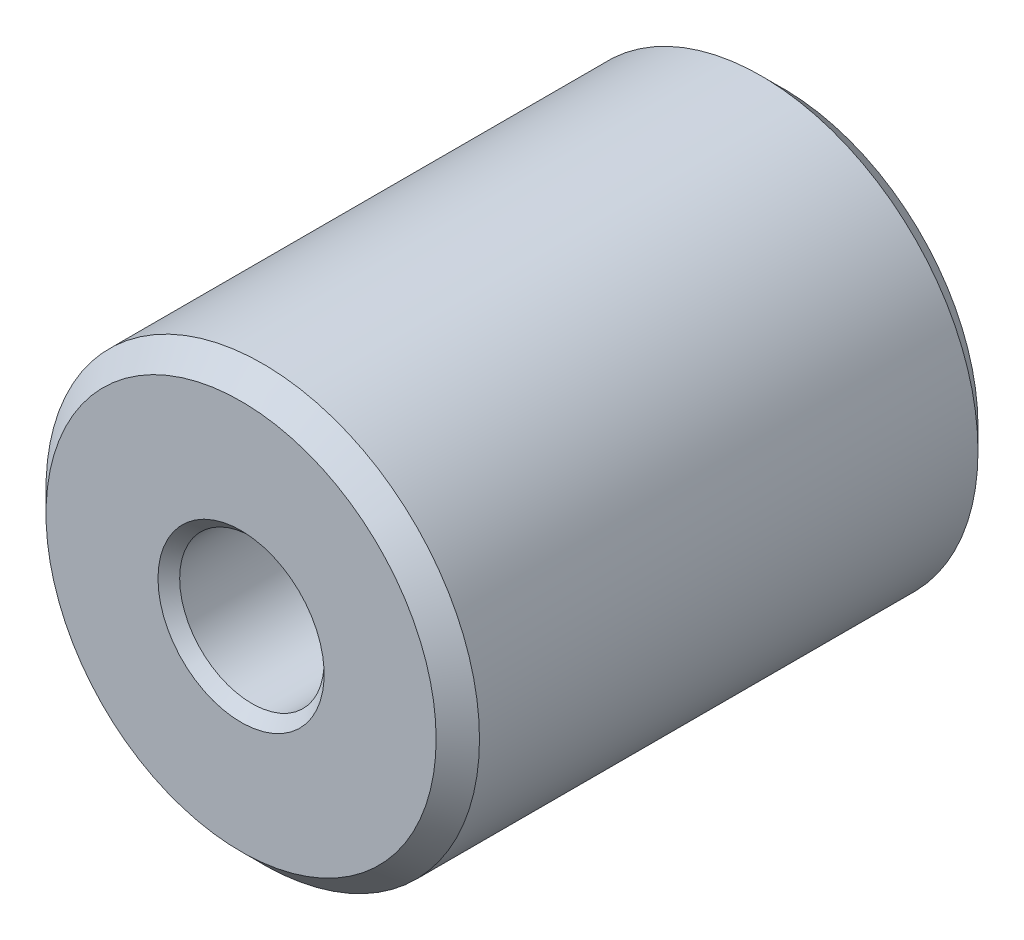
ISO-10303-21;
HEADER;
FILE_DESCRIPTION(('STEP AP214'),'2;1');
FILE_NAME('part.step','',(''),(''),'','','');
FILE_SCHEMA(('AUTOMOTIVE_DESIGN { 1 0 10303 214 1 1 1 1 }'));
ENDSEC;
DATA;
#1=APPLICATION_CONTEXT('core data for automotive mechanical design processes');
#2=APPLICATION_PROTOCOL_DEFINITION('international standard','automotive_design',2000,#1);
#3=PRODUCT_CONTEXT('',#1,'mechanical');
#4=PRODUCT('Part','Part','',(#3));
#5=PRODUCT_RELATED_PRODUCT_CATEGORY('part','',(#4));
#6=PRODUCT_DEFINITION_FORMATION('','',#4);
#7=PRODUCT_DEFINITION_CONTEXT('part definition',#1,'design');
#8=PRODUCT_DEFINITION('design','',#6,#7);
#9=PRODUCT_DEFINITION_SHAPE('','',#8);
#10=(LENGTH_UNIT() NAMED_UNIT(*) SI_UNIT(.MILLI.,.METRE.));
#11=(NAMED_UNIT(*) PLANE_ANGLE_UNIT() SI_UNIT($,.RADIAN.));
#12=(NAMED_UNIT(*) SI_UNIT($,.STERADIAN.) SOLID_ANGLE_UNIT());
#13=UNCERTAINTY_MEASURE_WITH_UNIT(LENGTH_MEASURE(1.E-05),#10,'distance_accuracy_value','');
#14=(GEOMETRIC_REPRESENTATION_CONTEXT(3) GLOBAL_UNCERTAINTY_ASSIGNED_CONTEXT((#13)) GLOBAL_UNIT_ASSIGNED_CONTEXT((#10,
#11,#12)) REPRESENTATION_CONTEXT('',''));
#15=CARTESIAN_POINT('',(0.,0.,0.));
#16=DIRECTION('',(0.,0.,1.));
#17=DIRECTION('',(1.,0.,0.));
#18=AXIS2_PLACEMENT_3D('',#15,#16,#17);
#19=CARTESIAN_POINT('',(0.,0.,30.));
#20=DIRECTION('',(0.,0.,1.));
#21=DIRECTION('',(1.,0.,0.));
#22=AXIS2_PLACEMENT_3D('',#19,#20,#21);
#23=PLANE('',#22);
#24=CARTESIAN_POINT('',(0.,0.,30.));
#25=DIRECTION('',(0.,0.,1.));
#26=DIRECTION('',(1.,0.,0.));
#27=AXIS2_PLACEMENT_3D('',#24,#25,#26);
#28=CIRCLE('',#27,10.8);
#29=CARTESIAN_POINT('',(10.8,0.,30.));
#30=VERTEX_POINT('',#29);
#31=EDGE_CURVE('E19',#30,#30,#28,.T.);
#32=ORIENTED_EDGE('',*,*,#31,.T.);
#33=EDGE_LOOP('',(#32));
#34=FACE_BOUND('',#33,.T.);
#35=CARTESIAN_POINT('',(0.,0.,30.));
#36=DIRECTION('',(0.,0.,-1.));
#37=DIRECTION('',(-1.,0.,0.));
#38=AXIS2_PLACEMENT_3D('',#35,#36,#37);
#39=CIRCLE('',#38,4.6);
#40=CARTESIAN_POINT('',(-4.6,0.,30.));
#41=VERTEX_POINT('',#40);
#42=EDGE_CURVE('E41',#41,#41,#39,.T.);
#43=ORIENTED_EDGE('',*,*,#42,.T.);
#44=EDGE_LOOP('',(#43));
#45=FACE_BOUND('',#44,.T.);
#46=ADVANCED_FACE('F12',(#34,#45),#23,.T.);
#47=CARTESIAN_POINT('',(0.,0.,30.));
#48=DIRECTION('',(0.,0.,-1.));
#49=DIRECTION('',(-1.,0.,0.));
#50=AXIS2_PLACEMENT_3D('',#47,#48,#49);
#51=CYLINDRICAL_SURFACE('',#50,12.);
#52=CARTESIAN_POINT('',(0.,0.,28.8));
#53=DIRECTION('',(0.,0.,1.));
#54=DIRECTION('',(1.,0.,0.));
#55=AXIS2_PLACEMENT_3D('',#52,#53,#54);
#56=CIRCLE('',#55,12.);
#57=CARTESIAN_POINT('',(12.,0.,28.8));
#58=VERTEX_POINT('',#57);
#59=EDGE_CURVE('E8',#58,#58,#56,.F.);
#60=ORIENTED_EDGE('',*,*,#59,.T.);
#61=EDGE_LOOP('',(#60));
#62=FACE_BOUND('',#61,.T.);
#63=CARTESIAN_POINT('',(0.,0.,1.2));
#64=DIRECTION('',(0.,0.,1.));
#65=DIRECTION('',(1.,0.,0.));
#66=AXIS2_PLACEMENT_3D('',#63,#64,#65);
#67=CIRCLE('',#66,12.);
#68=CARTESIAN_POINT('',(12.,0.,1.2));
#69=VERTEX_POINT('',#68);
#70=EDGE_CURVE('E27',#69,#69,#67,.T.);
#71=ORIENTED_EDGE('',*,*,#70,.T.);
#72=EDGE_LOOP('',(#71));
#73=FACE_BOUND('',#72,.T.);
#74=ADVANCED_FACE('F14',(#62,#73),#51,.T.);
#75=CARTESIAN_POINT('',(0.,0.,0.));
#76=DIRECTION('',(0.,0.,1.));
#77=DIRECTION('',(1.,0.,0.));
#78=AXIS2_PLACEMENT_3D('',#75,#76,#77);
#79=PLANE('',#78);
#80=CARTESIAN_POINT('',(0.,0.,0.));
#81=DIRECTION('',(0.,0.,-1.));
#82=DIRECTION('',(-1.,0.,0.));
#83=AXIS2_PLACEMENT_3D('',#80,#81,#82);
#84=CIRCLE('',#83,4.6);
#85=CARTESIAN_POINT('',(-4.6,0.,0.));
#86=VERTEX_POINT('',#85);
#87=EDGE_CURVE('E32',#86,#86,#84,.T.);
#88=ORIENTED_EDGE('',*,*,#87,.F.);
#89=EDGE_LOOP('',(#88));
#90=FACE_BOUND('',#89,.T.);
#91=CARTESIAN_POINT('',(0.,0.,0.));
#92=DIRECTION('',(0.,0.,1.));
#93=DIRECTION('',(1.,0.,0.));
#94=AXIS2_PLACEMENT_3D('',#91,#92,#93);
#95=CIRCLE('',#94,10.8);
#96=CARTESIAN_POINT('',(10.8,0.,0.));
#97=VERTEX_POINT('',#96);
#98=EDGE_CURVE('E23',#97,#97,#95,.F.);
#99=ORIENTED_EDGE('',*,*,#98,.T.);
#100=EDGE_LOOP('',(#99));
#101=FACE_BOUND('',#100,.T.);
#102=ADVANCED_FACE('F65',(#90,#101),#79,.F.);
#103=CARTESIAN_POINT('',(0.,0.,1.2));
#104=DIRECTION('',(0.,0.,1.));
#105=DIRECTION('',(1.,0.,0.));
#106=AXIS2_PLACEMENT_3D('',#103,#104,#105);
#107=CONICAL_SURFACE('',#106,12.,0.78539816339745);
#108=ORIENTED_EDGE('',*,*,#98,.F.);
#109=EDGE_LOOP('',(#108));
#110=FACE_BOUND('',#109,.T.);
#111=ORIENTED_EDGE('',*,*,#70,.F.);
#112=EDGE_LOOP('',(#111));
#113=FACE_BOUND('',#112,.T.);
#114=ADVANCED_FACE('F68',(#110,#113),#107,.T.);
#115=CARTESIAN_POINT('',(0.,0.,30.));
#116=DIRECTION('',(0.,0.,-1.));
#117=DIRECTION('',(-1.,0.,0.));
#118=AXIS2_PLACEMENT_3D('',#115,#116,#117);
#119=CONICAL_SURFACE('',#118,10.8,0.785398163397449);
#120=ORIENTED_EDGE('',*,*,#59,.F.);
#121=EDGE_LOOP('',(#120));
#122=FACE_BOUND('',#121,.T.);
#123=ORIENTED_EDGE('',*,*,#31,.F.);
#124=EDGE_LOOP('',(#123));
#125=FACE_BOUND('',#124,.T.);
#126=ADVANCED_FACE('F61',(#122,#125),#119,.T.);
#127=CARTESIAN_POINT('',(0.,0.,0.));
#128=DIRECTION('',(0.,0.,-1.));
#129=DIRECTION('',(-1.,0.,0.));
#130=AXIS2_PLACEMENT_3D('',#127,#128,#129);
#131=CONICAL_SURFACE('',#130,4.6,0.785398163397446);
#132=CARTESIAN_POINT('',(0.,0.,0.600000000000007));
#133=DIRECTION('',(0.,0.,-1.));
#134=DIRECTION('',(-1.,0.,0.));
#135=AXIS2_PLACEMENT_3D('',#132,#133,#134);
#136=CIRCLE('',#135,4.);
#137=CARTESIAN_POINT('',(-4.,0.,0.600000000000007));
#138=VERTEX_POINT('',#137);
#139=EDGE_CURVE('E35',#138,#138,#136,.T.);
#140=ORIENTED_EDGE('',*,*,#139,.F.);
#141=EDGE_LOOP('',(#140));
#142=FACE_BOUND('',#141,.T.);
#143=ORIENTED_EDGE('',*,*,#87,.T.);
#144=EDGE_LOOP('',(#143));
#145=FACE_BOUND('',#144,.T.);
#146=ADVANCED_FACE('F55',(#142,#145),#131,.F.);
#147=CARTESIAN_POINT('',(0.,0.,0.));
#148=DIRECTION('',(0.,0.,-1.));
#149=DIRECTION('',(-1.,0.,0.));
#150=AXIS2_PLACEMENT_3D('',#147,#148,#149);
#151=CYLINDRICAL_SURFACE('',#150,4.);
#152=CARTESIAN_POINT('',(0.,0.,29.4));
#153=DIRECTION('',(0.,0.,-1.));
#154=DIRECTION('',(-1.,0.,0.));
#155=AXIS2_PLACEMENT_3D('',#152,#153,#154);
#156=CIRCLE('',#155,4.);
#157=CARTESIAN_POINT('',(-4.,0.,29.4));
#158=VERTEX_POINT('',#157);
#159=EDGE_CURVE('E38',#158,#158,#156,.T.);
#160=ORIENTED_EDGE('',*,*,#159,.F.);
#161=EDGE_LOOP('',(#160));
#162=FACE_BOUND('',#161,.T.);
#163=ORIENTED_EDGE('',*,*,#139,.T.);
#164=EDGE_LOOP('',(#163));
#165=FACE_BOUND('',#164,.T.);
#166=ADVANCED_FACE('F49',(#162,#165),#151,.F.);
#167=CARTESIAN_POINT('',(0.,0.,29.4));
#168=DIRECTION('',(0.,0.,1.));
#169=DIRECTION('',(1.,0.,0.));
#170=AXIS2_PLACEMENT_3D('',#167,#168,#169);
#171=CONICAL_SURFACE('',#170,4.,0.785398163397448);
#172=ORIENTED_EDGE('',*,*,#42,.F.);
#173=EDGE_LOOP('',(#172));
#174=FACE_BOUND('',#173,.T.);
#175=ORIENTED_EDGE('',*,*,#159,.T.);
#176=EDGE_LOOP('',(#175));
#177=FACE_BOUND('',#176,.T.);
#178=ADVANCED_FACE('F46',(#174,#177),#171,.F.);
#179=CLOSED_SHELL('',(#46,#74,#102,#114,#126,#146,#166,#178));
#180=MANIFOLD_SOLID_BREP('B1',#179);
#181=ADVANCED_BREP_SHAPE_REPRESENTATION('',(#18,#180),#14);
#182=SHAPE_DEFINITION_REPRESENTATION(#9,#181);
ENDSEC;
END-ISO-10303-21;
